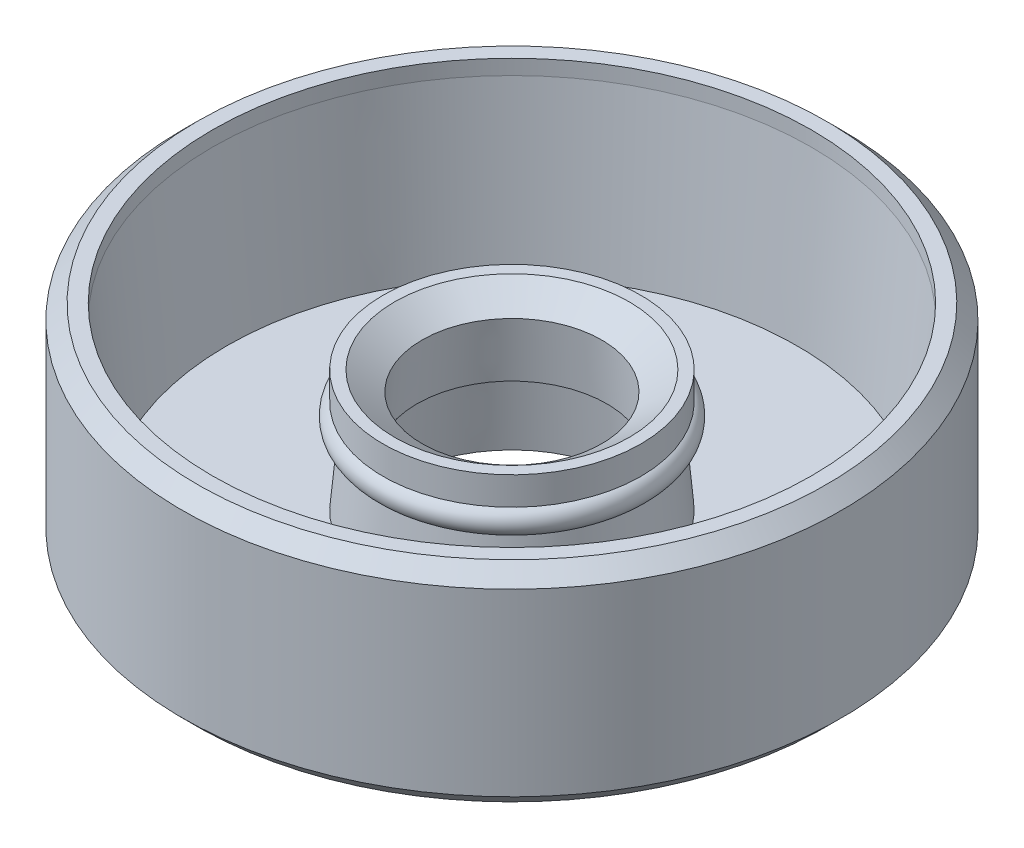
ISO-10303-21;
HEADER;
FILE_DESCRIPTION(('STEP AP214'),'2;1');
FILE_NAME('part.step','',(''),(''),'','','');
FILE_SCHEMA(('AUTOMOTIVE_DESIGN { 1 0 10303 214 1 1 1 1 }'));
ENDSEC;
DATA;
#1=APPLICATION_CONTEXT('core data for automotive mechanical design processes');
#2=APPLICATION_PROTOCOL_DEFINITION('international standard','automotive_design',2000,#1);
#3=PRODUCT_CONTEXT('',#1,'mechanical');
#4=PRODUCT('Part','Part','',(#3));
#5=PRODUCT_RELATED_PRODUCT_CATEGORY('part','',(#4));
#6=PRODUCT_DEFINITION_FORMATION('','',#4);
#7=PRODUCT_DEFINITION_CONTEXT('part definition',#1,'design');
#8=PRODUCT_DEFINITION('design','',#6,#7);
#9=PRODUCT_DEFINITION_SHAPE('','',#8);
#10=(LENGTH_UNIT() NAMED_UNIT(*) SI_UNIT(.MILLI.,.METRE.));
#11=(NAMED_UNIT(*) PLANE_ANGLE_UNIT() SI_UNIT($,.RADIAN.));
#12=(NAMED_UNIT(*) SI_UNIT($,.STERADIAN.) SOLID_ANGLE_UNIT());
#13=UNCERTAINTY_MEASURE_WITH_UNIT(LENGTH_MEASURE(1.E-05),#10,'distance_accuracy_value','');
#14=(GEOMETRIC_REPRESENTATION_CONTEXT(3) GLOBAL_UNCERTAINTY_ASSIGNED_CONTEXT((#13)) GLOBAL_UNIT_ASSIGNED_CONTEXT((#10,
#11,#12)) REPRESENTATION_CONTEXT('',''));
#15=CARTESIAN_POINT('',(0.,0.,0.));
#16=DIRECTION('',(0.,0.,1.));
#17=DIRECTION('',(1.,0.,0.));
#18=AXIS2_PLACEMENT_3D('',#15,#16,#17);
#19=CARTESIAN_POINT('',(0.,1.,0.));
#20=DIRECTION('',(0.,1.,0.));
#21=DIRECTION('',(-1.,0.,0.));
#22=AXIS2_PLACEMENT_3D('',#19,#20,#21);
#23=CONICAL_SURFACE('',#22,9.51881235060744,0.0872664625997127);
#24=CARTESIAN_POINT('',(0.,6.50000000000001,0.));
#25=DIRECTION('',(0.,1.,0.));
#26=DIRECTION('',(-1.,0.,0.));
#27=AXIS2_PLACEMENT_3D('',#24,#25,#26);
#28=CIRCLE('',#27,10.);
#29=CARTESIAN_POINT('',(-10.,6.50000000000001,0.));
#30=VERTEX_POINT('',#29);
#31=EDGE_CURVE('E10',#30,#30,#28,.T.);
#32=ORIENTED_EDGE('',*,*,#31,.T.);
#33=EDGE_LOOP('',(#32));
#34=FACE_BOUND('',#33,.T.);
#35=CARTESIAN_POINT('',(0.,1.,0.));
#36=DIRECTION('',(0.,1.,0.));
#37=DIRECTION('',(-1.,0.,0.));
#38=AXIS2_PLACEMENT_3D('',#35,#36,#37);
#39=CIRCLE('',#38,9.51881235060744);
#40=CARTESIAN_POINT('',(-9.51881235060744,1.,0.));
#41=VERTEX_POINT('',#40);
#42=EDGE_CURVE('E81',#41,#41,#39,.T.);
#43=ORIENTED_EDGE('',*,*,#42,.F.);
#44=EDGE_LOOP('',(#43));
#45=FACE_BOUND('',#44,.T.);
#46=ADVANCED_FACE('F29',(#34,#45),#23,.F.);
#47=CARTESIAN_POINT('',(0.,5.83619336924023,0.));
#48=DIRECTION('',(0.,1.,0.));
#49=DIRECTION('',(-1.,0.,0.));
#50=AXIS2_PLACEMENT_3D('',#47,#48,#49);
#51=CYLINDRICAL_SURFACE('',#50,10.);
#52=CARTESIAN_POINT('',(0.,7.00000000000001,0.));
#53=DIRECTION('',(0.,1.,0.));
#54=DIRECTION('',(-1.,0.,0.));
#55=AXIS2_PLACEMENT_3D('',#52,#53,#54);
#56=CIRCLE('',#55,10.);
#57=CARTESIAN_POINT('',(-10.,7.00000000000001,0.));
#58=VERTEX_POINT('',#57);
#59=EDGE_CURVE('E35',#58,#58,#56,.T.);
#60=ORIENTED_EDGE('',*,*,#59,.T.);
#61=EDGE_LOOP('',(#60));
#62=FACE_BOUND('',#61,.T.);
#63=ORIENTED_EDGE('',*,*,#31,.F.);
#64=EDGE_LOOP('',(#63));
#65=FACE_BOUND('',#64,.T.);
#66=ADVANCED_FACE('F89',(#62,#65),#51,.F.);
#67=CARTESIAN_POINT('',(-10.,7.,0.));
#68=DIRECTION('',(0.,1.,0.));
#69=DIRECTION('',(-1.,0.,0.));
#70=AXIS2_PLACEMENT_3D('',#67,#68,#69);
#71=PLANE('',#70);
#72=CARTESIAN_POINT('',(0.,7.00000000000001,0.));
#73=DIRECTION('',(0.,1.,0.));
#74=DIRECTION('',(-1.,0.,0.));
#75=AXIS2_PLACEMENT_3D('',#72,#73,#74);
#76=CIRCLE('',#75,10.5);
#77=CARTESIAN_POINT('',(-10.5,7.,0.));
#78=VERTEX_POINT('',#77);
#79=EDGE_CURVE('E39',#78,#78,#76,.T.);
#80=ORIENTED_EDGE('',*,*,#79,.T.);
#81=EDGE_LOOP('',(#80));
#82=FACE_BOUND('',#81,.T.);
#83=ORIENTED_EDGE('',*,*,#59,.F.);
#84=EDGE_LOOP('',(#83));
#85=FACE_BOUND('',#84,.T.);
#86=ADVANCED_FACE('F93',(#82,#85),#71,.T.);
#87=CARTESIAN_POINT('',(0.,7.00000000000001,0.));
#88=DIRECTION('',(0.,-1.,0.));
#89=DIRECTION('',(1.,0.,0.));
#90=AXIS2_PLACEMENT_3D('',#87,#88,#89);
#91=CONICAL_SURFACE('',#90,10.5,0.785398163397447);
#92=CARTESIAN_POINT('',(0.,6.50000000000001,0.));
#93=DIRECTION('',(0.,1.,0.));
#94=DIRECTION('',(-1.,0.,0.));
#95=AXIS2_PLACEMENT_3D('',#92,#93,#94);
#96=CIRCLE('',#95,11.);
#97=CARTESIAN_POINT('',(-11.,6.50000000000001,0.));
#98=VERTEX_POINT('',#97);
#99=EDGE_CURVE('E43',#98,#98,#96,.T.);
#100=ORIENTED_EDGE('',*,*,#99,.T.);
#101=EDGE_LOOP('',(#100));
#102=FACE_BOUND('',#101,.T.);
#103=ORIENTED_EDGE('',*,*,#79,.F.);
#104=EDGE_LOOP('',(#103));
#105=FACE_BOUND('',#104,.T.);
#106=ADVANCED_FACE('F97',(#102,#105),#91,.T.);
#107=CARTESIAN_POINT('',(0.,5.83619336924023,0.));
#108=DIRECTION('',(0.,1.,0.));
#109=DIRECTION('',(-1.,0.,0.));
#110=AXIS2_PLACEMENT_3D('',#107,#108,#109);
#111=CYLINDRICAL_SURFACE('',#110,11.);
#112=CARTESIAN_POINT('',(0.,0.5,0.));
#113=DIRECTION('',(0.,1.,0.));
#114=DIRECTION('',(-1.,0.,0.));
#115=AXIS2_PLACEMENT_3D('',#112,#113,#114);
#116=CIRCLE('',#115,11.);
#117=CARTESIAN_POINT('',(-11.,0.499999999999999,0.));
#118=VERTEX_POINT('',#117);
#119=EDGE_CURVE('E48',#118,#118,#116,.T.);
#120=ORIENTED_EDGE('',*,*,#119,.T.);
#121=EDGE_LOOP('',(#120));
#122=FACE_BOUND('',#121,.T.);
#123=ORIENTED_EDGE('',*,*,#99,.F.);
#124=EDGE_LOOP('',(#123));
#125=FACE_BOUND('',#124,.T.);
#126=ADVANCED_FACE('F104',(#122,#125),#111,.T.);
#127=CARTESIAN_POINT('',(0.,0.5,0.));
#128=DIRECTION('',(0.,1.,0.));
#129=DIRECTION('',(-1.,0.,0.));
#130=AXIS2_PLACEMENT_3D('',#127,#128,#129);
#131=CONICAL_SURFACE('',#130,11.,0.785398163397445);
#132=CARTESIAN_POINT('',(0.,0.,0.));
#133=DIRECTION('',(0.,1.,0.));
#134=DIRECTION('',(-1.,0.,0.));
#135=AXIS2_PLACEMENT_3D('',#132,#133,#134);
#136=CIRCLE('',#135,10.5);
#137=CARTESIAN_POINT('',(-10.5,0.,0.));
#138=VERTEX_POINT('',#137);
#139=EDGE_CURVE('E51',#138,#138,#136,.T.);
#140=ORIENTED_EDGE('',*,*,#139,.T.);
#141=EDGE_LOOP('',(#140));
#142=FACE_BOUND('',#141,.T.);
#143=ORIENTED_EDGE('',*,*,#119,.F.);
#144=EDGE_LOOP('',(#143));
#145=FACE_BOUND('',#144,.T.);
#146=ADVANCED_FACE('F108',(#142,#145),#131,.T.);
#147=CARTESIAN_POINT('',(-10.5,0.,0.));
#148=DIRECTION('',(0.,-1.,0.));
#149=DIRECTION('',(1.,0.,0.));
#150=AXIS2_PLACEMENT_3D('',#147,#148,#149);
#151=PLANE('',#150);
#152=CARTESIAN_POINT('',(0.,0.,0.));
#153=DIRECTION('',(0.,1.,0.));
#154=DIRECTION('',(-1.,0.,0.));
#155=AXIS2_PLACEMENT_3D('',#152,#153,#154);
#156=CIRCLE('',#155,3.88744979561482);
#157=CARTESIAN_POINT('',(-3.88744979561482,0.,0.));
#158=VERTEX_POINT('',#157);
#159=EDGE_CURVE('E54',#158,#158,#156,.T.);
#160=ORIENTED_EDGE('',*,*,#159,.T.);
#161=EDGE_LOOP('',(#160));
#162=FACE_BOUND('',#161,.T.);
#163=ORIENTED_EDGE('',*,*,#139,.F.);
#164=EDGE_LOOP('',(#163));
#165=FACE_BOUND('',#164,.T.);
#166=ADVANCED_FACE('F112',(#162,#165),#151,.T.);
#167=CARTESIAN_POINT('',(0.,0.,0.));
#168=DIRECTION('',(0.,-1.,0.));
#169=DIRECTION('',(1.,0.,0.));
#170=AXIS2_PLACEMENT_3D('',#167,#168,#169);
#171=CONICAL_SURFACE('',#170,3.88744979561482,0.0872664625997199);
#172=CARTESIAN_POINT('',(0.,2.5,0.));
#173=DIRECTION('',(0.,1.,0.));
#174=DIRECTION('',(-1.,0.,0.));
#175=AXIS2_PLACEMENT_3D('',#172,#173,#174);
#176=CIRCLE('',#175,3.6687281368);
#177=CARTESIAN_POINT('',(-3.6687281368,2.5,0.));
#178=VERTEX_POINT('',#177);
#179=EDGE_CURVE('E57',#178,#178,#176,.T.);
#180=ORIENTED_EDGE('',*,*,#179,.T.);
#181=EDGE_LOOP('',(#180));
#182=FACE_BOUND('',#181,.T.);
#183=ORIENTED_EDGE('',*,*,#159,.F.);
#184=EDGE_LOOP('',(#183));
#185=FACE_BOUND('',#184,.T.);
#186=ADVANCED_FACE('F116',(#182,#185),#171,.F.);
#187=CARTESIAN_POINT('',(-3.1687281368,2.5,0.));
#188=DIRECTION('',(0.,-1.,0.));
#189=DIRECTION('',(1.,0.,0.));
#190=AXIS2_PLACEMENT_3D('',#187,#188,#189);
#191=PLANE('',#190);
#192=CARTESIAN_POINT('',(0.,2.5,0.));
#193=DIRECTION('',(0.,1.,0.));
#194=DIRECTION('',(-1.,0.,0.));
#195=AXIS2_PLACEMENT_3D('',#192,#193,#194);
#196=CIRCLE('',#195,3.1687281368);
#197=CARTESIAN_POINT('',(-3.1687281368,2.5,0.));
#198=VERTEX_POINT('',#197);
#199=EDGE_CURVE('E60',#198,#198,#196,.T.);
#200=ORIENTED_EDGE('',*,*,#199,.T.);
#201=EDGE_LOOP('',(#200));
#202=FACE_BOUND('',#201,.T.);
#203=ORIENTED_EDGE('',*,*,#179,.F.);
#204=EDGE_LOOP('',(#203));
#205=FACE_BOUND('',#204,.T.);
#206=ADVANCED_FACE('F120',(#202,#205),#191,.T.);
#207=CARTESIAN_POINT('',(0.,2.5,0.));
#208=DIRECTION('',(0.,-1.,0.));
#209=DIRECTION('',(1.,0.,0.));
#210=AXIS2_PLACEMENT_3D('',#207,#208,#209);
#211=CONICAL_SURFACE('',#210,3.1687281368,0.0872664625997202);
#212=CARTESIAN_POINT('',(0.,4.42857142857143,0.));
#213=DIRECTION('',(0.,1.,0.));
#214=DIRECTION('',(-1.,0.,0.));
#215=AXIS2_PLACEMENT_3D('',#212,#213,#214);
#216=CIRCLE('',#215,3.);
#217=CARTESIAN_POINT('',(-3.,4.42857142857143,0.));
#218=VERTEX_POINT('',#217);
#219=EDGE_CURVE('E63',#218,#218,#216,.T.);
#220=ORIENTED_EDGE('',*,*,#219,.T.);
#221=EDGE_LOOP('',(#220));
#222=FACE_BOUND('',#221,.T.);
#223=ORIENTED_EDGE('',*,*,#199,.F.);
#224=EDGE_LOOP('',(#223));
#225=FACE_BOUND('',#224,.T.);
#226=ADVANCED_FACE('F124',(#222,#225),#211,.F.);
#227=CARTESIAN_POINT('',(0.,4.42857142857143,0.));
#228=DIRECTION('',(0.,1.,0.));
#229=DIRECTION('',(-1.,0.,0.));
#230=AXIS2_PLACEMENT_3D('',#227,#228,#229);
#231=CONICAL_SURFACE('',#230,3.,0.95993108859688);
#232=CARTESIAN_POINT('',(0.,5.07142857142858,0.));
#233=DIRECTION('',(0.,1.,0.));
#234=DIRECTION('',(-1.,0.,0.));
#235=AXIS2_PLACEMENT_3D('',#232,#233,#234);
#236=CIRCLE('',#235,3.91809514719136);
#237=CARTESIAN_POINT('',(-3.91809514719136,5.07142857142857,0.));
#238=VERTEX_POINT('',#237);
#239=EDGE_CURVE('E66',#238,#238,#236,.T.);
#240=ORIENTED_EDGE('',*,*,#239,.T.);
#241=EDGE_LOOP('',(#240));
#242=FACE_BOUND('',#241,.T.);
#243=ORIENTED_EDGE('',*,*,#219,.F.);
#244=EDGE_LOOP('',(#243));
#245=FACE_BOUND('',#244,.T.);
#246=ADVANCED_FACE('F128',(#242,#245),#231,.F.);
#247=CARTESIAN_POINT('',(-3.91809514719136,5.07142857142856,0.));
#248=DIRECTION('',(0.,1.,0.));
#249=DIRECTION('',(-1.,0.,0.));
#250=AXIS2_PLACEMENT_3D('',#247,#248,#249);
#251=PLANE('',#250);
#252=CARTESIAN_POINT('',(0.,5.07142857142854,0.));
#253=DIRECTION('',(0.,1.,0.));
#254=DIRECTION('',(-1.,0.,0.));
#255=AXIS2_PLACEMENT_3D('',#252,#253,#254);
#256=CIRCLE('',#255,4.30187105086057);
#257=CARTESIAN_POINT('',(-4.30187105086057,5.07142857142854,0.));
#258=VERTEX_POINT('',#257);
#259=EDGE_CURVE('E69',#258,#258,#256,.T.);
#260=ORIENTED_EDGE('',*,*,#259,.T.);
#261=EDGE_LOOP('',(#260));
#262=FACE_BOUND('',#261,.T.);
#263=ORIENTED_EDGE('',*,*,#239,.F.);
#264=EDGE_LOOP('',(#263));
#265=FACE_BOUND('',#264,.T.);
#266=ADVANCED_FACE('F132',(#262,#265),#251,.T.);
#267=CARTESIAN_POINT('',(0.,5.83619336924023,0.));
#268=DIRECTION('',(0.,1.,0.));
#269=DIRECTION('',(-1.,0.,0.));
#270=AXIS2_PLACEMENT_3D('',#267,#268,#269);
#271=CYLINDRICAL_SURFACE('',#270,4.30187105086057);
#272=CARTESIAN_POINT('',(0.,4.13322405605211,0.));
#273=DIRECTION('',(0.,1.,0.));
#274=DIRECTION('',(-1.,0.,0.));
#275=AXIS2_PLACEMENT_3D('',#272,#273,#274);
#276=CIRCLE('',#275,4.30187105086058);
#277=CARTESIAN_POINT('',(-4.30187105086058,4.13322405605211,0.));
#278=VERTEX_POINT('',#277);
#279=EDGE_CURVE('E72',#278,#278,#276,.T.);
#280=ORIENTED_EDGE('',*,*,#279,.T.);
#281=EDGE_LOOP('',(#280));
#282=FACE_BOUND('',#281,.T.);
#283=ORIENTED_EDGE('',*,*,#259,.F.);
#284=EDGE_LOOP('',(#283));
#285=FACE_BOUND('',#284,.T.);
#286=ADVANCED_FACE('F136',(#282,#285),#271,.T.);
#287=CARTESIAN_POINT('',(0.,3.73322405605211,0.));
#288=DIRECTION('',(0.,1.,0.));
#289=DIRECTION('',(-1.,0.,0.));
#290=AXIS2_PLACEMENT_3D('',#287,#288,#289);
#291=TOROIDAL_SURFACE('',#290,4.10187105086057,0.447213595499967);
#292=CARTESIAN_POINT('',(0.,3.28601046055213,0.));
#293=DIRECTION('',(0.,1.,0.));
#294=DIRECTION('',(-1.,0.,0.));
#295=AXIS2_PLACEMENT_3D('',#292,#293,#294);
#296=CIRCLE('',#295,4.10187105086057);
#297=CARTESIAN_POINT('',(-4.10187105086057,3.28601046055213,0.));
#298=VERTEX_POINT('',#297);
#299=EDGE_CURVE('E75',#298,#298,#296,.T.);
#300=ORIENTED_EDGE('',*,*,#299,.T.);
#301=EDGE_LOOP('',(#300));
#302=FACE_BOUND('',#301,.T.);
#303=ORIENTED_EDGE('',*,*,#279,.F.);
#304=EDGE_LOOP('',(#303));
#305=FACE_BOUND('',#304,.T.);
#306=ADVANCED_FACE('F140',(#302,#305),#291,.T.);
#307=CARTESIAN_POINT('',(0.,3.28601046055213,0.));
#308=DIRECTION('',(0.,-1.,0.));
#309=DIRECTION('',(1.,0.,0.));
#310=AXIS2_PLACEMENT_3D('',#307,#308,#309);
#311=CONICAL_SURFACE('',#310,4.10187105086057,0.0872664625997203);
#312=CARTESIAN_POINT('',(0.,0.999999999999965,0.));
#313=DIRECTION('',(0.,1.,0.));
#314=DIRECTION('',(-1.,0.,0.));
#315=AXIS2_PLACEMENT_3D('',#312,#313,#314);
#316=CIRCLE('',#315,4.30187105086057);
#317=CARTESIAN_POINT('',(-4.30187105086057,0.999999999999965,0.));
#318=VERTEX_POINT('',#317);
#319=EDGE_CURVE('E78',#318,#318,#316,.T.);
#320=ORIENTED_EDGE('',*,*,#319,.T.);
#321=EDGE_LOOP('',(#320));
#322=FACE_BOUND('',#321,.T.);
#323=ORIENTED_EDGE('',*,*,#299,.F.);
#324=EDGE_LOOP('',(#323));
#325=FACE_BOUND('',#324,.T.);
#326=ADVANCED_FACE('F144',(#322,#325),#311,.T.);
#327=CARTESIAN_POINT('',(-9.51881235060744,0.999999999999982,0.));
#328=DIRECTION('',(0.,1.,0.));
#329=DIRECTION('',(-1.,0.,0.));
#330=AXIS2_PLACEMENT_3D('',#327,#328,#329);
#331=PLANE('',#330);
#332=ORIENTED_EDGE('',*,*,#42,.T.);
#333=EDGE_LOOP('',(#332));
#334=FACE_BOUND('',#333,.T.);
#335=ORIENTED_EDGE('',*,*,#319,.F.);
#336=EDGE_LOOP('',(#335));
#337=FACE_BOUND('',#336,.T.);
#338=ADVANCED_FACE('F85',(#334,#337),#331,.T.);
#339=CLOSED_SHELL('',(#46,#66,#86,#106,#126,#146,#166,#186,#206,#226,#246,#266,#286,#306,#326,#338));
#340=MANIFOLD_SOLID_BREP('B2',#339);
#341=ADVANCED_BREP_SHAPE_REPRESENTATION('',(#18,#340),#14);
#342=SHAPE_DEFINITION_REPRESENTATION(#9,#341);
ENDSEC;
END-ISO-10303-21;
